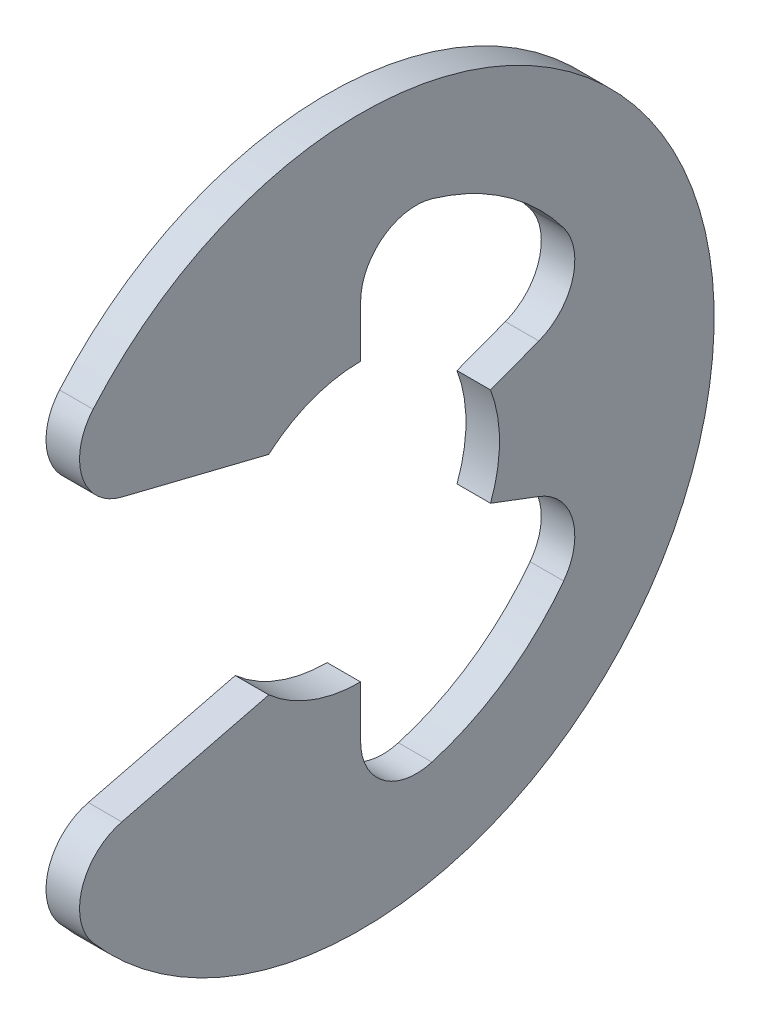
from build123d import *

# Parameters (mm, degrees)
EXTRUDE1_DEPTH = 0.3175
FILLET1_R      = 1.0541


with BuildPart() as part:
    # Sketch1 → Extrude1 (new, symmetric)
    with BuildSketch(Plane(origin=(0, 0, 0), x_dir=(0, 0, -1), z_dir=(1, 0, 0))):
        with BuildLine():
            Line((-5.971542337, -3.022514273), (-1.738853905, -1.971675))
            ThreePointArc((-1.738853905, -1.971675), (-0.929456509, -2.459110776), (0, -2.6289))
            Line((0, -2.6289), (0, -4.811251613))
            ThreePointArc((0, -4.811251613), (2.735327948, -3.958045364), (4.500513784, -1.701034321))
            Line((4.500513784, -1.701034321), (2.459110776, -0.929456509))
            ThreePointArc((2.459110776, -0.929456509), (2.6289, 0), (2.459110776, 0.929456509))
            Line((2.459110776, 0.929456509), (4.500513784, 1.701034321))
            ThreePointArc((4.500513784, 1.701034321), (2.735327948, 3.958045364), (0, 4.811251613))
            Line((0, 4.811251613), (0, 2.6289))
            ThreePointArc((0, 2.6289), (-0.929456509, 2.459110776), (-1.738853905, 1.971675))
            Line((-1.738853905, 1.971675), (-5.971542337, 3.022514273))
            ThreePointArc((-5.971542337, 3.022514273), (6.6929, 0), (-5.971542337, -3.022514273))
        make_face()
    extrude(amount=EXTRUDE1_DEPTH, both=True)

    # Fillet1
    fillet1_edges = [part.edges().sort_by_distance(p)[0] for p in [
        (0, -3.022514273, 5.971542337),
        (0, -4.811251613, 0),
        (0, -1.701034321, -4.500513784),
        (0, 1.701034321, -4.500513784),
        (0, 4.811251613, 0),
        (0, 3.022514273, 5.971542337),
    ]]
    fillet(fillet1_edges, radius=FILLET1_R)


solid = part.part
